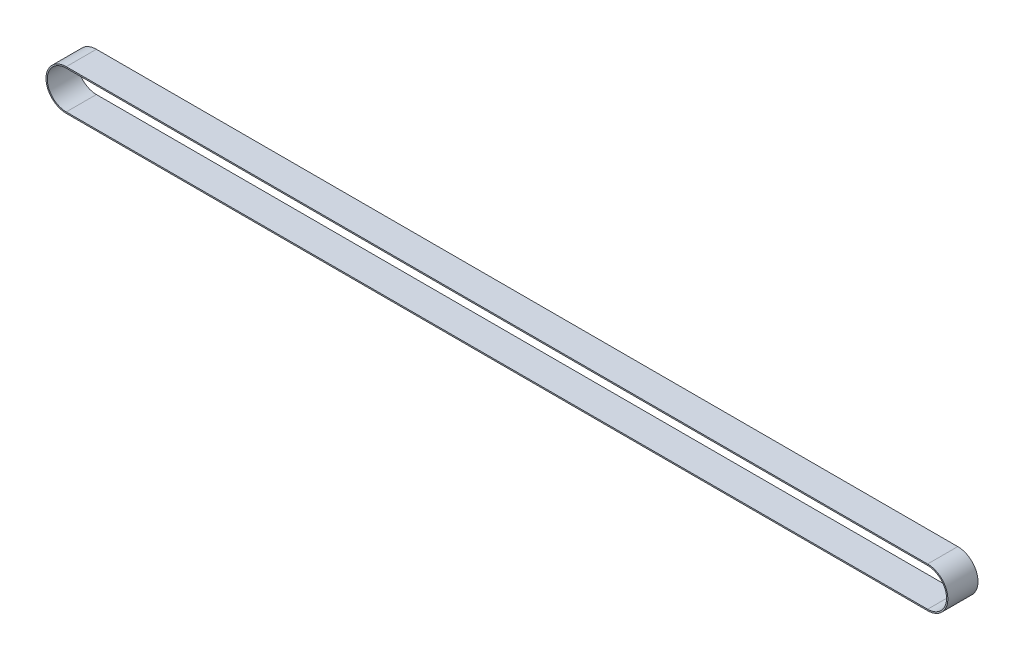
from build123d import *

# Parameters (mm, degrees)
EXTRUDE_THIN1_DEPTH = 17.5


with BuildPart() as part:
    # Sketch2 → Extrude-Thin1 (new, symmetric)
    with BuildSketch(Plane.XY):
        with BuildLine():
            Line((-70.5, 159.5), (929.5, 159.5))
            ThreePointArc((929.5, 159.5), (953, 136), (929.5, 112.5))
            Line((929.5, 112.5), (-70.5, 112.5))
            ThreePointArc((-70.5, 112.5), (-94, 136), (-70.5, 159.5))
        make_face()
        with BuildLine():
            Line((-70.5, 158), (929.5, 158))
            ThreePointArc((929.5, 158), (951.5, 136), (929.5, 114))
            Line((929.5, 114), (-70.5, 114))
            ThreePointArc((-70.5, 114), (-92.5, 136), (-70.5, 158))
        make_face(mode=Mode.SUBTRACT)
    extrude(amount=EXTRUDE_THIN1_DEPTH, both=True)


solid = part.part
